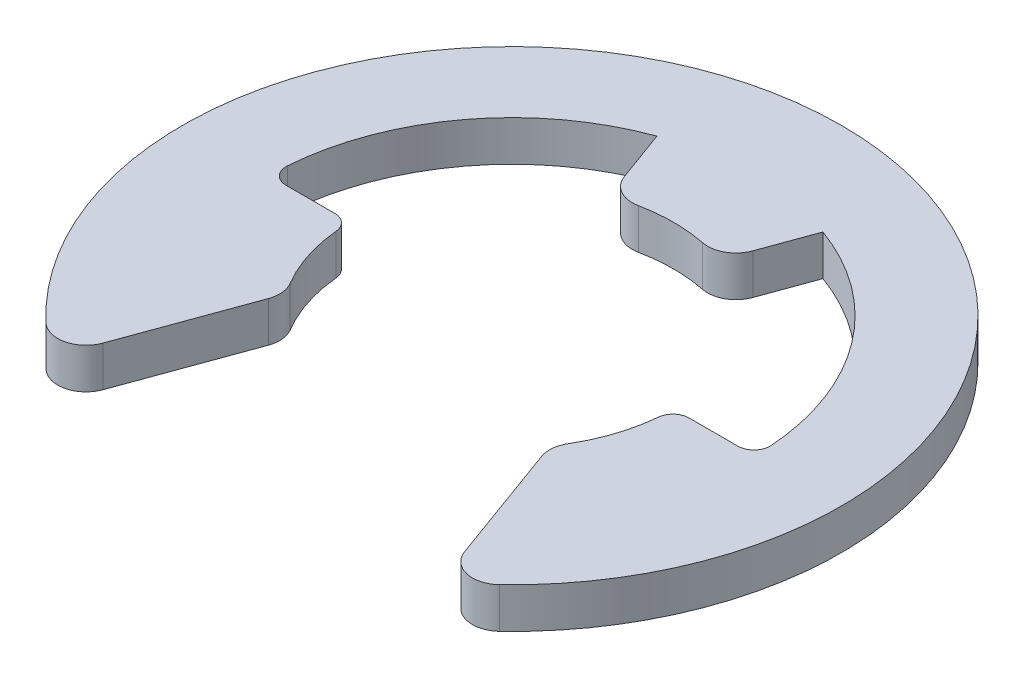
from build123d import *

# Parameters (mm, degrees)
BOSS_EXTRUDE1_DEPTH = 0.5
FILLET1_R           = 0.7
FILLET2_R           = 0.4


with BuildPart() as part:
    # Sketch2 → Boss-Extrude1 (new, symmetric)
    with BuildSketch(Plane(origin=(0, 0, 0), x_dir=(1, 0, 0), z_dir=(0, 1, 0))):
        with BuildLine():
            Line((-4.810806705, -6.57865023), (-3.26, -2.317843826))
            ThreePointArc((-3.26, -2.317843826), (-3.810511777, -1.216552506), (-4, 0))
            Line((-4, 0), (-6, 0))
            ThreePointArc((-6, 0), (-4.914912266, 3.441458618), (-2.05212086, 5.638155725))
            Line((-2.05212086, 5.638155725), (-1.368080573, 3.758770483))
            ThreePointArc((-1.368080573, 3.758770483), (0, 4), (1.368080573, 3.758770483))
            Line((1.368080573, 3.758770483), (2.05212086, 5.638155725))
            ThreePointArc((2.05212086, 5.638155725), (4.914912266, 3.441458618), (6, 0))
            Line((6, 0), (4, 0))
            ThreePointArc((4, 0), (3.810511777, -1.216552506), (3.26, -2.317843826))
            Line((3.26, -2.317843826), (4.810806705, -6.57865023))
            ThreePointArc((4.810806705, -6.57865023), (0, 8.15), (-4.810806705, -6.57865023))
        make_face()
    extrude(amount=BOSS_EXTRUDE1_DEPTH, both=True)

    # Fillet1
    fillet1_edges = [part.edges().sort_by_distance(p)[0] for p in [
        (-3.26, 0, 2.317843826),
        (-4.810806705, 0, 6.57865023),
        (4.810806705, 0, 6.57865023),
        (3.26, 0, 2.317843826),
        (1.368080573, 0, -3.758770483),
        (-1.368080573, 0, -3.758770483),
    ]]
    fillet(fillet1_edges, radius=FILLET1_R)

    # Fillet2
    fillet2_edges = [part.edges().sort_by_distance(p)[0] for p in [
        (-6, 0, 0),
        (-4, 0, 0),
        (4, 0, 0),
        (6, 0, 0),
    ]]
    fillet(fillet2_edges, radius=FILLET2_R)


solid = part.part
